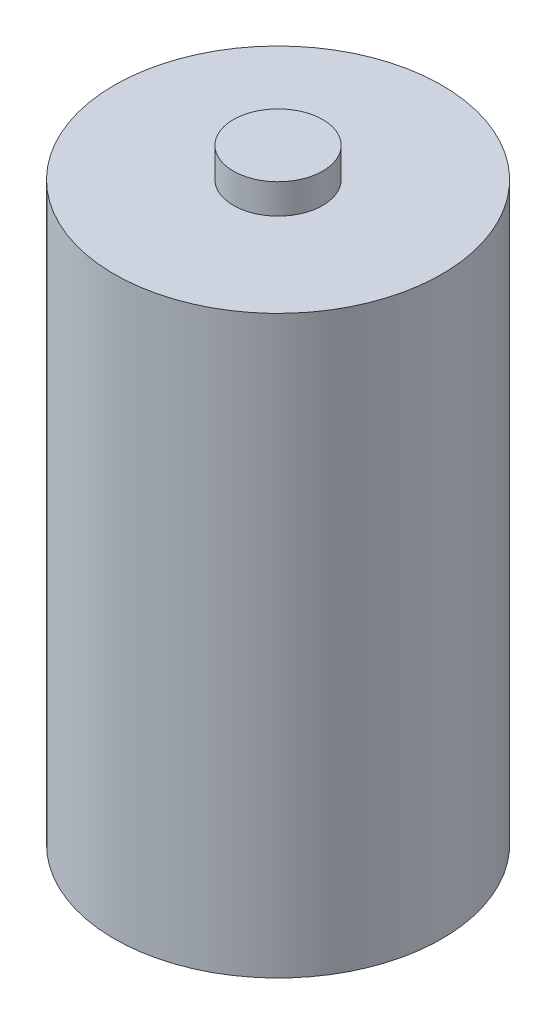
ISO-10303-21;
HEADER;
FILE_DESCRIPTION(('STEP AP214'),'2;1');
FILE_NAME('part.step','',(''),(''),'','','');
FILE_SCHEMA(('AUTOMOTIVE_DESIGN { 1 0 10303 214 1 1 1 1 }'));
ENDSEC;
DATA;
#1=APPLICATION_CONTEXT('core data for automotive mechanical design processes');
#2=APPLICATION_PROTOCOL_DEFINITION('international standard','automotive_design',2000,#1);
#3=PRODUCT_CONTEXT('',#1,'mechanical');
#4=PRODUCT('Part','Part','',(#3));
#5=PRODUCT_RELATED_PRODUCT_CATEGORY('part','',(#4));
#6=PRODUCT_DEFINITION_FORMATION('','',#4);
#7=PRODUCT_DEFINITION_CONTEXT('part definition',#1,'design');
#8=PRODUCT_DEFINITION('design','',#6,#7);
#9=PRODUCT_DEFINITION_SHAPE('','',#8);
#10=(LENGTH_UNIT() NAMED_UNIT(*) SI_UNIT(.MILLI.,.METRE.));
#11=(NAMED_UNIT(*) PLANE_ANGLE_UNIT() SI_UNIT($,.RADIAN.));
#12=(NAMED_UNIT(*) SI_UNIT($,.STERADIAN.) SOLID_ANGLE_UNIT());
#13=UNCERTAINTY_MEASURE_WITH_UNIT(LENGTH_MEASURE(1.E-05),#10,'distance_accuracy_value','');
#14=(GEOMETRIC_REPRESENTATION_CONTEXT(3) GLOBAL_UNCERTAINTY_ASSIGNED_CONTEXT((#13)) GLOBAL_UNIT_ASSIGNED_CONTEXT((#10,
#11,#12)) REPRESENTATION_CONTEXT('',''));
#15=CARTESIAN_POINT('',(0.,0.,0.));
#16=DIRECTION('',(0.,0.,1.));
#17=DIRECTION('',(1.,0.,0.));
#18=AXIS2_PLACEMENT_3D('',#15,#16,#17);
#19=CARTESIAN_POINT('',(4.49999999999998,60.9999999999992,0.));
#20=DIRECTION('',(0.,-1.,0.));
#21=DIRECTION('',(1.,0.,0.));
#22=AXIS2_PLACEMENT_3D('',#19,#20,#21);
#23=PLANE('',#22);
#24=CARTESIAN_POINT('',(0.,60.9999999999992,0.));
#25=DIRECTION('',(0.,1.,0.));
#26=DIRECTION('',(-1.,0.,0.));
#27=AXIS2_PLACEMENT_3D('',#24,#25,#26);
#28=CIRCLE('',#27,4.50000000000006);
#29=CARTESIAN_POINT('',(-4.50000000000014,60.9999999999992,0.));
#30=VERTEX_POINT('',#29);
#31=EDGE_CURVE('E18',#30,#30,#28,.F.);
#32=ORIENTED_EDGE('',*,*,#31,.F.);
#33=EDGE_LOOP('',(#32));
#34=FACE_BOUND('',#33,.T.);
#35=ADVANCED_FACE('F15',(#34),#23,.F.);
#36=CARTESIAN_POINT('',(0.,60.9999999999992,0.));
#37=DIRECTION('',(0.,1.,0.));
#38=DIRECTION('',(-1.,0.,0.));
#39=AXIS2_PLACEMENT_3D('',#36,#37,#38);
#40=CYLINDRICAL_SURFACE('',#39,4.50000000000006);
#41=ORIENTED_EDGE('',*,*,#31,.T.);
#42=EDGE_LOOP('',(#41));
#43=FACE_BOUND('',#42,.T.);
#44=CARTESIAN_POINT('',(0.,57.9999999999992,0.));
#45=DIRECTION('',(0.,1.,0.));
#46=DIRECTION('',(-1.,0.,0.));
#47=AXIS2_PLACEMENT_3D('',#44,#45,#46);
#48=CIRCLE('',#47,4.50000000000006);
#49=CARTESIAN_POINT('',(-4.50000000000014,57.9999999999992,0.));
#50=VERTEX_POINT('',#49);
#51=EDGE_CURVE('E27',#50,#50,#48,.T.);
#52=ORIENTED_EDGE('',*,*,#51,.T.);
#53=EDGE_LOOP('',(#52));
#54=FACE_BOUND('',#53,.T.);
#55=ADVANCED_FACE('F35',(#43,#54),#40,.T.);
#56=CARTESIAN_POINT('',(0.,0.,0.));
#57=DIRECTION('',(0.,1.,0.));
#58=DIRECTION('',(-1.,0.,0.));
#59=AXIS2_PLACEMENT_3D('',#56,#57,#58);
#60=PLANE('',#59);
#61=CARTESIAN_POINT('',(0.,0.,0.));
#62=DIRECTION('',(0.,1.,0.));
#63=DIRECTION('',(-1.,0.,0.));
#64=AXIS2_PLACEMENT_3D('',#61,#62,#63);
#65=CIRCLE('',#64,16.5000000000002);
#66=CARTESIAN_POINT('',(-16.5000000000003,0.,0.));
#67=VERTEX_POINT('',#66);
#68=EDGE_CURVE('E22',#67,#67,#65,.T.);
#69=ORIENTED_EDGE('',*,*,#68,.F.);
#70=EDGE_LOOP('',(#69));
#71=FACE_BOUND('',#70,.T.);
#72=ADVANCED_FACE('F42',(#71),#60,.F.);
#73=CARTESIAN_POINT('',(16.5000000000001,57.9999999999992,0.));
#74=DIRECTION('',(0.,-1.,0.));
#75=DIRECTION('',(1.,0.,0.));
#76=AXIS2_PLACEMENT_3D('',#73,#74,#75);
#77=PLANE('',#76);
#78=CARTESIAN_POINT('',(0.,57.9999999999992,0.));
#79=DIRECTION('',(0.,1.,0.));
#80=DIRECTION('',(-1.,0.,0.));
#81=AXIS2_PLACEMENT_3D('',#78,#79,#80);
#82=CIRCLE('',#81,16.5000000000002);
#83=CARTESIAN_POINT('',(-16.5000000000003,57.9999999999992,0.));
#84=VERTEX_POINT('',#83);
#85=EDGE_CURVE('E10',#84,#84,#82,.F.);
#86=ORIENTED_EDGE('',*,*,#85,.F.);
#87=EDGE_LOOP('',(#86));
#88=FACE_BOUND('',#87,.T.);
#89=ORIENTED_EDGE('',*,*,#51,.F.);
#90=EDGE_LOOP('',(#89));
#91=FACE_BOUND('',#90,.T.);
#92=ADVANCED_FACE('F45',(#88,#91),#77,.F.);
#93=CARTESIAN_POINT('',(0.,60.9999999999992,0.));
#94=DIRECTION('',(0.,1.,0.));
#95=DIRECTION('',(-1.,0.,0.));
#96=AXIS2_PLACEMENT_3D('',#93,#94,#95);
#97=CYLINDRICAL_SURFACE('',#96,16.5000000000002);
#98=ORIENTED_EDGE('',*,*,#68,.T.);
#99=EDGE_LOOP('',(#98));
#100=FACE_BOUND('',#99,.T.);
#101=ORIENTED_EDGE('',*,*,#85,.T.);
#102=EDGE_LOOP('',(#101));
#103=FACE_BOUND('',#102,.T.);
#104=ADVANCED_FACE('F43',(#100,#103),#97,.T.);
#105=CLOSED_SHELL('',(#35,#55,#72,#92,#104));
#106=MANIFOLD_SOLID_BREP('B1',#105);
#107=ADVANCED_BREP_SHAPE_REPRESENTATION('',(#18,#106),#14);
#108=SHAPE_DEFINITION_REPRESENTATION(#9,#107);
ENDSEC;
END-ISO-10303-21;
